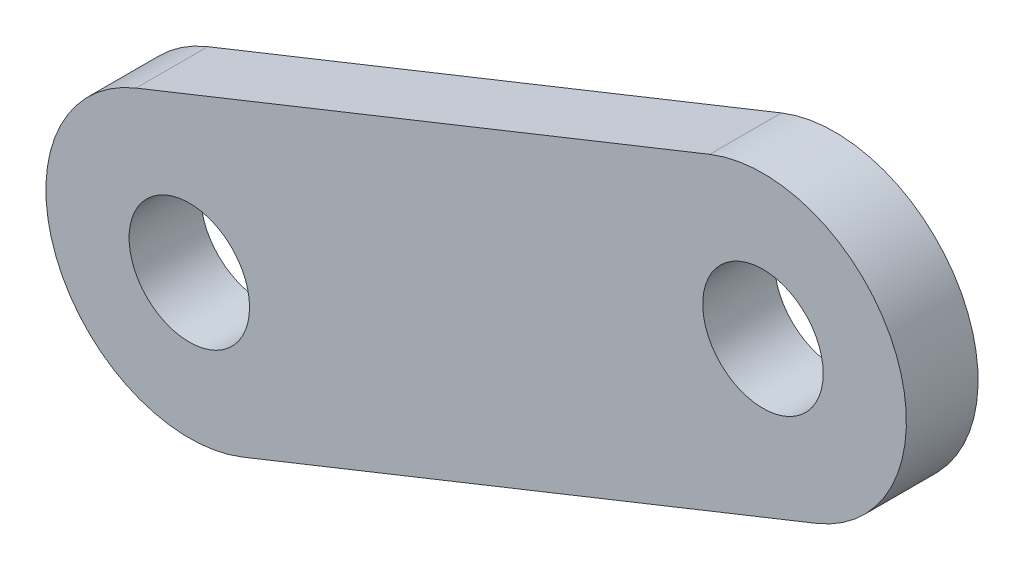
ISO-10303-21;
HEADER;
FILE_DESCRIPTION(('STEP AP214'),'2;1');
FILE_NAME('part.step','',(''),(''),'','','');
FILE_SCHEMA(('AUTOMOTIVE_DESIGN { 1 0 10303 214 1 1 1 1 }'));
ENDSEC;
DATA;
#1=APPLICATION_CONTEXT('core data for automotive mechanical design processes');
#2=APPLICATION_PROTOCOL_DEFINITION('international standard','automotive_design',2000,#1);
#3=PRODUCT_CONTEXT('',#1,'mechanical');
#4=PRODUCT('Part','Part','',(#3));
#5=PRODUCT_RELATED_PRODUCT_CATEGORY('part','',(#4));
#6=PRODUCT_DEFINITION_FORMATION('','',#4);
#7=PRODUCT_DEFINITION_CONTEXT('part definition',#1,'design');
#8=PRODUCT_DEFINITION('design','',#6,#7);
#9=PRODUCT_DEFINITION_SHAPE('','',#8);
#10=(LENGTH_UNIT() NAMED_UNIT(*) SI_UNIT(.MILLI.,.METRE.));
#11=(NAMED_UNIT(*) PLANE_ANGLE_UNIT() SI_UNIT($,.RADIAN.));
#12=(NAMED_UNIT(*) SI_UNIT($,.STERADIAN.) SOLID_ANGLE_UNIT());
#13=UNCERTAINTY_MEASURE_WITH_UNIT(LENGTH_MEASURE(1.E-05),#10,'distance_accuracy_value','');
#14=(GEOMETRIC_REPRESENTATION_CONTEXT(3) GLOBAL_UNCERTAINTY_ASSIGNED_CONTEXT((#13)) GLOBAL_UNIT_ASSIGNED_CONTEXT((#10,
#11,#12)) REPRESENTATION_CONTEXT('',''));
#15=CARTESIAN_POINT('',(0.,0.,0.));
#16=DIRECTION('',(0.,0.,1.));
#17=DIRECTION('',(1.,0.,0.));
#18=AXIS2_PLACEMENT_3D('',#15,#16,#17);
#19=CARTESIAN_POINT('',(-40.,-36.,68.9));
#20=DIRECTION('',(0.,0.,1.));
#21=DIRECTION('',(1.,0.,0.));
#22=AXIS2_PLACEMENT_3D('',#19,#20,#21);
#23=PLANE('',#22);
#24=CARTESIAN_POINT('',(-20.,-28.,68.9));
#25=DIRECTION('',(0.,0.,1.));
#26=DIRECTION('',(1.,0.,0.));
#27=AXIS2_PLACEMENT_3D('',#24,#25,#26);
#28=CIRCLE('',#27,2.1);
#29=CARTESIAN_POINT('',(-17.9,-28.,68.9));
#30=VERTEX_POINT('',#29);
#31=EDGE_CURVE('E102',#30,#30,#28,.T.);
#32=ORIENTED_EDGE('',*,*,#31,.F.);
#33=EDGE_LOOP('',(#32));
#34=FACE_BOUND('',#33,.T.);
#35=CARTESIAN_POINT('',(-40.,-36.,68.9));
#36=DIRECTION('',(0.,0.,1.));
#37=DIRECTION('',(1.,0.,0.));
#38=AXIS2_PLACEMENT_3D('',#35,#36,#37);
#39=CIRCLE('',#38,5.);
#40=CARTESIAN_POINT('',(-41.8569533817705,-31.3576165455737,68.9));
#41=VERTEX_POINT('',#40);
#42=CARTESIAN_POINT('',(-38.1430466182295,-40.6423834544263,68.9));
#43=VERTEX_POINT('',#42);
#44=EDGE_CURVE('E87',#41,#43,#39,.T.);
#45=ORIENTED_EDGE('',*,*,#44,.T.);
#46=DIRECTION('',(0.928476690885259,0.371390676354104,0.));
#47=VECTOR('',#46,1.);
#48=CARTESIAN_POINT('',(-38.1430466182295,-40.6423834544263,68.9));
#49=LINE('',#48,#47);
#50=CARTESIAN_POINT('',(-18.1430466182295,-32.6423834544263,68.9));
#51=VERTEX_POINT('',#50);
#52=EDGE_CURVE('E82',#43,#51,#49,.T.);
#53=ORIENTED_EDGE('',*,*,#52,.T.);
#54=CARTESIAN_POINT('',(-20.,-28.,68.9));
#55=DIRECTION('',(0.,0.,1.));
#56=DIRECTION('',(1.,0.,0.));
#57=AXIS2_PLACEMENT_3D('',#54,#55,#56);
#58=CIRCLE('',#57,5.);
#59=CARTESIAN_POINT('',(-21.8569533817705,-23.3576165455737,68.9));
#60=VERTEX_POINT('',#59);
#61=EDGE_CURVE('E85',#51,#60,#58,.T.);
#62=ORIENTED_EDGE('',*,*,#61,.T.);
#63=DIRECTION('',(-0.928476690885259,-0.371390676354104,0.));
#64=VECTOR('',#63,1.);
#65=CARTESIAN_POINT('',(-21.8569533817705,-23.3576165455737,68.9));
#66=LINE('',#65,#64);
#67=EDGE_CURVE('E52',#60,#41,#66,.T.);
#68=ORIENTED_EDGE('',*,*,#67,.T.);
#69=EDGE_LOOP('',(#45,#53,#62,#68));
#70=FACE_BOUND('',#69,.T.);
#71=CARTESIAN_POINT('',(-40.,-36.,68.9));
#72=DIRECTION('',(0.,0.,1.));
#73=DIRECTION('',(1.,0.,0.));
#74=AXIS2_PLACEMENT_3D('',#71,#72,#73);
#75=CIRCLE('',#74,2.1);
#76=CARTESIAN_POINT('',(-37.9,-36.,68.9));
#77=VERTEX_POINT('',#76);
#78=EDGE_CURVE('E117',#77,#77,#75,.T.);
#79=ORIENTED_EDGE('',*,*,#78,.F.);
#80=EDGE_LOOP('',(#79));
#81=FACE_BOUND('',#80,.T.);
#82=ADVANCED_FACE('F35',(#34,#70,#81),#23,.T.);
#83=CARTESIAN_POINT('',(-40.,-36.,66.4));
#84=DIRECTION('',(0.,0.,1.));
#85=DIRECTION('',(1.,0.,0.));
#86=AXIS2_PLACEMENT_3D('',#83,#84,#85);
#87=PLANE('',#86);
#88=CARTESIAN_POINT('',(-40.,-36.,66.4));
#89=DIRECTION('',(0.,0.,1.));
#90=DIRECTION('',(1.,0.,0.));
#91=AXIS2_PLACEMENT_3D('',#88,#89,#90);
#92=CIRCLE('',#91,5.);
#93=CARTESIAN_POINT('',(-41.8569533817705,-31.3576165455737,66.4));
#94=VERTEX_POINT('',#93);
#95=CARTESIAN_POINT('',(-38.1430466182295,-40.6423834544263,66.4));
#96=VERTEX_POINT('',#95);
#97=EDGE_CURVE('E99',#94,#96,#92,.T.);
#98=ORIENTED_EDGE('',*,*,#97,.F.);
#99=DIRECTION('',(-0.928476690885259,-0.371390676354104,0.));
#100=VECTOR('',#99,1.);
#101=CARTESIAN_POINT('',(-21.8569533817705,-23.3576165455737,66.4));
#102=LINE('',#101,#100);
#103=CARTESIAN_POINT('',(-21.8569533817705,-23.3576165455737,66.4));
#104=VERTEX_POINT('',#103);
#105=EDGE_CURVE('E75',#104,#94,#102,.T.);
#106=ORIENTED_EDGE('',*,*,#105,.F.);
#107=CARTESIAN_POINT('',(-20.,-28.,66.4));
#108=DIRECTION('',(0.,0.,1.));
#109=DIRECTION('',(1.,0.,0.));
#110=AXIS2_PLACEMENT_3D('',#107,#108,#109);
#111=CIRCLE('',#110,5.);
#112=CARTESIAN_POINT('',(-18.1430466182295,-32.6423834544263,66.4));
#113=VERTEX_POINT('',#112);
#114=EDGE_CURVE('E69',#113,#104,#111,.T.);
#115=ORIENTED_EDGE('',*,*,#114,.F.);
#116=DIRECTION('',(0.928476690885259,0.371390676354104,0.));
#117=VECTOR('',#116,1.);
#118=CARTESIAN_POINT('',(-38.1430466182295,-40.6423834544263,66.4));
#119=LINE('',#118,#117);
#120=EDGE_CURVE('E91',#96,#113,#119,.T.);
#121=ORIENTED_EDGE('',*,*,#120,.F.);
#122=EDGE_LOOP('',(#98,#106,#115,#121));
#123=FACE_BOUND('',#122,.T.);
#124=CARTESIAN_POINT('',(-20.,-28.,66.4));
#125=DIRECTION('',(0.,0.,1.));
#126=DIRECTION('',(1.,0.,0.));
#127=AXIS2_PLACEMENT_3D('',#124,#125,#126);
#128=CIRCLE('',#127,2.1);
#129=CARTESIAN_POINT('',(-17.9,-28.,66.4));
#130=VERTEX_POINT('',#129);
#131=EDGE_CURVE('E114',#130,#130,#128,.T.);
#132=ORIENTED_EDGE('',*,*,#131,.T.);
#133=EDGE_LOOP('',(#132));
#134=FACE_BOUND('',#133,.T.);
#135=CARTESIAN_POINT('',(-40.,-36.,66.4));
#136=DIRECTION('',(0.,0.,1.));
#137=DIRECTION('',(1.,0.,0.));
#138=AXIS2_PLACEMENT_3D('',#135,#136,#137);
#139=CIRCLE('',#138,2.1);
#140=CARTESIAN_POINT('',(-37.9,-36.,66.4));
#141=VERTEX_POINT('',#140);
#142=EDGE_CURVE('E120',#141,#141,#139,.T.);
#143=ORIENTED_EDGE('',*,*,#142,.T.);
#144=EDGE_LOOP('',(#143));
#145=FACE_BOUND('',#144,.T.);
#146=ADVANCED_FACE('F110',(#123,#134,#145),#87,.F.);
#147=CARTESIAN_POINT('',(-40.,-36.,68.9));
#148=DIRECTION('',(0.,0.,-1.));
#149=DIRECTION('',(-1.,0.,0.));
#150=AXIS2_PLACEMENT_3D('',#147,#148,#149);
#151=CYLINDRICAL_SURFACE('',#150,5.);
#152=ORIENTED_EDGE('',*,*,#97,.T.);
#153=DIRECTION('',(0.,0.,-1.));
#154=VECTOR('',#153,1.);
#155=CARTESIAN_POINT('',(-38.1430466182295,-40.6423834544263,68.9));
#156=LINE('',#155,#154);
#157=EDGE_CURVE('E11',#43,#96,#156,.T.);
#158=ORIENTED_EDGE('',*,*,#157,.F.);
#159=ORIENTED_EDGE('',*,*,#44,.F.);
#160=DIRECTION('',(0.,0.,-1.));
#161=VECTOR('',#160,1.);
#162=CARTESIAN_POINT('',(-41.8569533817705,-31.3576165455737,68.9));
#163=LINE('',#162,#161);
#164=EDGE_CURVE('E95',#41,#94,#163,.T.);
#165=ORIENTED_EDGE('',*,*,#164,.T.);
#166=EDGE_LOOP('',(#152,#158,#159,#165));
#167=FACE_BOUND('',#166,.T.);
#168=ADVANCED_FACE('F37',(#167),#151,.T.);
#169=CARTESIAN_POINT('',(-38.1430466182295,-40.6423834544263,68.9));
#170=DIRECTION('',(-0.371390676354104,0.928476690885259,0.));
#171=DIRECTION('',(-0.928476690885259,-0.371390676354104,0.));
#172=AXIS2_PLACEMENT_3D('',#169,#170,#171);
#173=PLANE('',#172);
#174=ORIENTED_EDGE('',*,*,#120,.T.);
#175=DIRECTION('',(0.,0.,-1.));
#176=VECTOR('',#175,1.);
#177=CARTESIAN_POINT('',(-18.1430466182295,-32.6423834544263,68.9));
#178=LINE('',#177,#176);
#179=EDGE_CURVE('E44',#51,#113,#178,.T.);
#180=ORIENTED_EDGE('',*,*,#179,.F.);
#181=ORIENTED_EDGE('',*,*,#52,.F.);
#182=ORIENTED_EDGE('',*,*,#157,.T.);
#183=EDGE_LOOP('',(#174,#180,#181,#182));
#184=FACE_BOUND('',#183,.T.);
#185=ADVANCED_FACE('F90',(#184),#173,.F.);
#186=CARTESIAN_POINT('',(-20.,-28.,68.9));
#187=DIRECTION('',(0.,0.,-1.));
#188=DIRECTION('',(-1.,0.,0.));
#189=AXIS2_PLACEMENT_3D('',#186,#187,#188);
#190=CYLINDRICAL_SURFACE('',#189,5.);
#191=ORIENTED_EDGE('',*,*,#114,.T.);
#192=DIRECTION('',(0.,0.,-1.));
#193=VECTOR('',#192,1.);
#194=CARTESIAN_POINT('',(-21.8569533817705,-23.3576165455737,68.9));
#195=LINE('',#194,#193);
#196=EDGE_CURVE('E92',#60,#104,#195,.T.);
#197=ORIENTED_EDGE('',*,*,#196,.F.);
#198=ORIENTED_EDGE('',*,*,#61,.F.);
#199=ORIENTED_EDGE('',*,*,#179,.T.);
#200=EDGE_LOOP('',(#191,#197,#198,#199));
#201=FACE_BOUND('',#200,.T.);
#202=ADVANCED_FACE('F93',(#201),#190,.T.);
#203=CARTESIAN_POINT('',(-21.8569533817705,-23.3576165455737,68.9));
#204=DIRECTION('',(0.371390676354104,-0.928476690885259,0.));
#205=DIRECTION('',(0.928476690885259,0.371390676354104,0.));
#206=AXIS2_PLACEMENT_3D('',#203,#204,#205);
#207=PLANE('',#206);
#208=ORIENTED_EDGE('',*,*,#105,.T.);
#209=ORIENTED_EDGE('',*,*,#164,.F.);
#210=ORIENTED_EDGE('',*,*,#67,.F.);
#211=ORIENTED_EDGE('',*,*,#196,.T.);
#212=EDGE_LOOP('',(#208,#209,#210,#211));
#213=FACE_BOUND('',#212,.T.);
#214=ADVANCED_FACE('F107',(#213),#207,.F.);
#215=CARTESIAN_POINT('',(-20.,-28.,68.9));
#216=DIRECTION('',(0.,0.,-1.));
#217=DIRECTION('',(-1.,0.,0.));
#218=AXIS2_PLACEMENT_3D('',#215,#216,#217);
#219=CYLINDRICAL_SURFACE('',#218,2.1);
#220=ORIENTED_EDGE('',*,*,#31,.T.);
#221=EDGE_LOOP('',(#220));
#222=FACE_BOUND('',#221,.T.);
#223=ORIENTED_EDGE('',*,*,#131,.F.);
#224=EDGE_LOOP('',(#223));
#225=FACE_BOUND('',#224,.T.);
#226=ADVANCED_FACE('F137',(#222,#225),#219,.F.);
#227=CARTESIAN_POINT('',(-40.,-36.,68.9));
#228=DIRECTION('',(0.,0.,-1.));
#229=DIRECTION('',(-1.,0.,0.));
#230=AXIS2_PLACEMENT_3D('',#227,#228,#229);
#231=CYLINDRICAL_SURFACE('',#230,2.1);
#232=ORIENTED_EDGE('',*,*,#78,.T.);
#233=EDGE_LOOP('',(#232));
#234=FACE_BOUND('',#233,.T.);
#235=ORIENTED_EDGE('',*,*,#142,.F.);
#236=EDGE_LOOP('',(#235));
#237=FACE_BOUND('',#236,.T.);
#238=ADVANCED_FACE('F126',(#234,#237),#231,.F.);
#239=CLOSED_SHELL('',(#82,#146,#168,#185,#202,#214,#226,#238));
#240=MANIFOLD_SOLID_BREP('B2',#239);
#241=ADVANCED_BREP_SHAPE_REPRESENTATION('',(#18,#240),#14);
#242=SHAPE_DEFINITION_REPRESENTATION(#9,#241);
ENDSEC;
END-ISO-10303-21;
